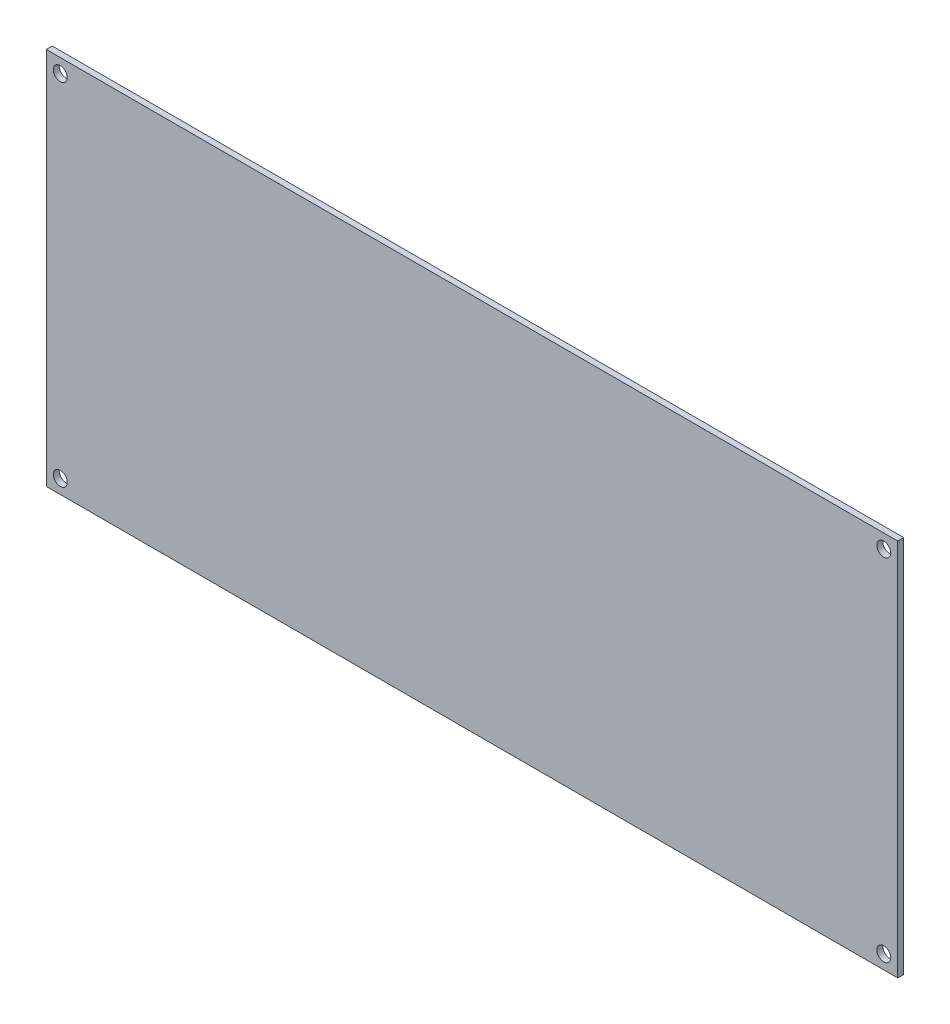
ISO-10303-21;
HEADER;
FILE_DESCRIPTION(('STEP AP214'),'2;1');
FILE_NAME('part.step','',(''),(''),'','','');
FILE_SCHEMA(('AUTOMOTIVE_DESIGN { 1 0 10303 214 1 1 1 1 }'));
ENDSEC;
DATA;
#1=APPLICATION_CONTEXT('core data for automotive mechanical design processes');
#2=APPLICATION_PROTOCOL_DEFINITION('international standard','automotive_design',2000,#1);
#3=PRODUCT_CONTEXT('',#1,'mechanical');
#4=PRODUCT('Part','Part','',(#3));
#5=PRODUCT_RELATED_PRODUCT_CATEGORY('part','',(#4));
#6=PRODUCT_DEFINITION_FORMATION('','',#4);
#7=PRODUCT_DEFINITION_CONTEXT('part definition',#1,'design');
#8=PRODUCT_DEFINITION('design','',#6,#7);
#9=PRODUCT_DEFINITION_SHAPE('','',#8);
#10=(LENGTH_UNIT() NAMED_UNIT(*) SI_UNIT(.MILLI.,.METRE.));
#11=(NAMED_UNIT(*) PLANE_ANGLE_UNIT() SI_UNIT($,.RADIAN.));
#12=(NAMED_UNIT(*) SI_UNIT($,.STERADIAN.) SOLID_ANGLE_UNIT());
#13=UNCERTAINTY_MEASURE_WITH_UNIT(LENGTH_MEASURE(1.E-05),#10,'distance_accuracy_value','');
#14=(GEOMETRIC_REPRESENTATION_CONTEXT(3) GLOBAL_UNCERTAINTY_ASSIGNED_CONTEXT((#13)) GLOBAL_UNIT_ASSIGNED_CONTEXT((#10,
#11,#12)) REPRESENTATION_CONTEXT('',''));
#15=CARTESIAN_POINT('',(0.,0.,0.));
#16=DIRECTION('',(0.,0.,1.));
#17=DIRECTION('',(1.,0.,0.));
#18=AXIS2_PLACEMENT_3D('',#15,#16,#17);
#19=CARTESIAN_POINT('',(0.,0.,1.6));
#20=DIRECTION('',(1.,0.,0.));
#21=DIRECTION('',(0.,0.,-1.));
#22=AXIS2_PLACEMENT_3D('',#19,#20,#21);
#23=PLANE('',#22);
#24=DIRECTION('',(0.,-1.,0.));
#25=VECTOR('',#24,1.);
#26=CARTESIAN_POINT('',(0.,0.,0.));
#27=LINE('',#26,#25);
#28=CARTESIAN_POINT('',(0.,101.6,0.));
#29=VERTEX_POINT('',#28);
#30=CARTESIAN_POINT('',(0.,0.,0.));
#31=VERTEX_POINT('',#30);
#32=EDGE_CURVE('E98',#29,#31,#27,.T.);
#33=ORIENTED_EDGE('',*,*,#32,.T.);
#34=DIRECTION('',(0.,0.,-1.));
#35=VECTOR('',#34,1.);
#36=CARTESIAN_POINT('',(0.,0.,1.6));
#37=LINE('',#36,#35);
#38=CARTESIAN_POINT('',(0.,0.,1.6));
#39=VERTEX_POINT('',#38);
#40=EDGE_CURVE('E11',#39,#31,#37,.T.);
#41=ORIENTED_EDGE('',*,*,#40,.F.);
#42=DIRECTION('',(0.,-1.,0.));
#43=VECTOR('',#42,1.);
#44=CARTESIAN_POINT('',(0.,0.,1.6));
#45=LINE('',#44,#43);
#46=CARTESIAN_POINT('',(0.,101.6,1.6));
#47=VERTEX_POINT('',#46);
#48=EDGE_CURVE('E86',#47,#39,#45,.T.);
#49=ORIENTED_EDGE('',*,*,#48,.F.);
#50=DIRECTION('',(0.,0.,-1.));
#51=VECTOR('',#50,1.);
#52=CARTESIAN_POINT('',(0.,101.6,1.6));
#53=LINE('',#52,#51);
#54=EDGE_CURVE('E94',#47,#29,#53,.T.);
#55=ORIENTED_EDGE('',*,*,#54,.T.);
#56=EDGE_LOOP('',(#33,#41,#49,#55));
#57=FACE_BOUND('',#56,.T.);
#58=ADVANCED_FACE('F35',(#57),#23,.F.);
#59=CARTESIAN_POINT('',(0.,0.,1.6));
#60=DIRECTION('',(0.,1.,0.));
#61=DIRECTION('',(0.,0.,1.));
#62=AXIS2_PLACEMENT_3D('',#59,#60,#61);
#63=PLANE('',#62);
#64=DIRECTION('',(1.,0.,0.));
#65=VECTOR('',#64,1.);
#66=CARTESIAN_POINT('',(0.,0.,0.));
#67=LINE('',#66,#65);
#68=CARTESIAN_POINT('',(228.6,0.,0.));
#69=VERTEX_POINT('',#68);
#70=EDGE_CURVE('E90',#31,#69,#67,.T.);
#71=ORIENTED_EDGE('',*,*,#70,.T.);
#72=DIRECTION('',(0.,0.,-1.));
#73=VECTOR('',#72,1.);
#74=CARTESIAN_POINT('',(228.6,0.,1.6));
#75=LINE('',#74,#73);
#76=CARTESIAN_POINT('',(228.6,0.,1.6));
#77=VERTEX_POINT('',#76);
#78=EDGE_CURVE('E43',#77,#69,#75,.T.);
#79=ORIENTED_EDGE('',*,*,#78,.F.);
#80=DIRECTION('',(1.,0.,0.));
#81=VECTOR('',#80,1.);
#82=CARTESIAN_POINT('',(0.,0.,1.6));
#83=LINE('',#82,#81);
#84=EDGE_CURVE('E81',#39,#77,#83,.T.);
#85=ORIENTED_EDGE('',*,*,#84,.F.);
#86=ORIENTED_EDGE('',*,*,#40,.T.);
#87=EDGE_LOOP('',(#71,#79,#85,#86));
#88=FACE_BOUND('',#87,.T.);
#89=ADVANCED_FACE('F89',(#88),#63,.F.);
#90=CARTESIAN_POINT('',(228.6,0.,1.6));
#91=DIRECTION('',(-1.,0.,0.));
#92=DIRECTION('',(0.,-1.,0.));
#93=AXIS2_PLACEMENT_3D('',#90,#91,#92);
#94=PLANE('',#93);
#95=DIRECTION('',(0.,1.,0.));
#96=VECTOR('',#95,1.);
#97=CARTESIAN_POINT('',(228.6,0.,0.));
#98=LINE('',#97,#96);
#99=CARTESIAN_POINT('',(228.6,101.6,0.));
#100=VERTEX_POINT('',#99);
#101=EDGE_CURVE('E68',#69,#100,#98,.T.);
#102=ORIENTED_EDGE('',*,*,#101,.T.);
#103=DIRECTION('',(0.,0.,-1.));
#104=VECTOR('',#103,1.);
#105=CARTESIAN_POINT('',(228.6,101.6,1.6));
#106=LINE('',#105,#104);
#107=CARTESIAN_POINT('',(228.6,101.6,1.6));
#108=VERTEX_POINT('',#107);
#109=EDGE_CURVE('E91',#108,#100,#106,.T.);
#110=ORIENTED_EDGE('',*,*,#109,.F.);
#111=DIRECTION('',(0.,1.,0.));
#112=VECTOR('',#111,1.);
#113=CARTESIAN_POINT('',(228.6,0.,1.6));
#114=LINE('',#113,#112);
#115=EDGE_CURVE('E84',#77,#108,#114,.T.);
#116=ORIENTED_EDGE('',*,*,#115,.F.);
#117=ORIENTED_EDGE('',*,*,#78,.T.);
#118=EDGE_LOOP('',(#102,#110,#116,#117));
#119=FACE_BOUND('',#118,.T.);
#120=ADVANCED_FACE('F92',(#119),#94,.F.);
#121=CARTESIAN_POINT('',(0.,101.6,1.6));
#122=DIRECTION('',(0.,-1.,0.));
#123=DIRECTION('',(0.,0.,-1.));
#124=AXIS2_PLACEMENT_3D('',#121,#122,#123);
#125=PLANE('',#124);
#126=DIRECTION('',(-1.,0.,0.));
#127=VECTOR('',#126,1.);
#128=CARTESIAN_POINT('',(0.,101.6,0.));
#129=LINE('',#128,#127);
#130=EDGE_CURVE('E74',#100,#29,#129,.T.);
#131=ORIENTED_EDGE('',*,*,#130,.T.);
#132=ORIENTED_EDGE('',*,*,#54,.F.);
#133=DIRECTION('',(-1.,0.,0.));
#134=VECTOR('',#133,1.);
#135=CARTESIAN_POINT('',(0.,101.6,1.6));
#136=LINE('',#135,#134);
#137=EDGE_CURVE('E51',#108,#47,#136,.T.);
#138=ORIENTED_EDGE('',*,*,#137,.F.);
#139=ORIENTED_EDGE('',*,*,#109,.T.);
#140=EDGE_LOOP('',(#131,#132,#138,#139));
#141=FACE_BOUND('',#140,.T.);
#142=ADVANCED_FACE('F106',(#141),#125,.F.);
#143=CARTESIAN_POINT('',(0.,101.6,1.6));
#144=DIRECTION('',(0.,0.,-1.));
#145=DIRECTION('',(-1.,0.,0.));
#146=AXIS2_PLACEMENT_3D('',#143,#144,#145);
#147=PLANE('',#146);
#148=CARTESIAN_POINT('',(3.75,3.75,1.6));
#149=DIRECTION('',(0.,0.,1.));
#150=DIRECTION('',(1.,0.,0.));
#151=AXIS2_PLACEMENT_3D('',#148,#149,#150);
#152=CIRCLE('',#151,1.875);
#153=CARTESIAN_POINT('',(5.62500000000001,3.75,1.6));
#154=VERTEX_POINT('',#153);
#155=EDGE_CURVE('E130',#154,#154,#152,.T.);
#156=ORIENTED_EDGE('',*,*,#155,.F.);
#157=EDGE_LOOP('',(#156));
#158=FACE_BOUND('',#157,.T.);
#159=CARTESIAN_POINT('',(224.85,3.75,1.6));
#160=DIRECTION('',(0.,0.,1.));
#161=DIRECTION('',(1.,0.,0.));
#162=AXIS2_PLACEMENT_3D('',#159,#160,#161);
#163=CIRCLE('',#162,1.87499999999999);
#164=CARTESIAN_POINT('',(226.725,3.75,1.6));
#165=VERTEX_POINT('',#164);
#166=EDGE_CURVE('E124',#165,#165,#163,.T.);
#167=ORIENTED_EDGE('',*,*,#166,.F.);
#168=EDGE_LOOP('',(#167));
#169=FACE_BOUND('',#168,.T.);
#170=CARTESIAN_POINT('',(224.85,97.85,1.6));
#171=DIRECTION('',(0.,0.,1.));
#172=DIRECTION('',(1.,0.,0.));
#173=AXIS2_PLACEMENT_3D('',#170,#171,#172);
#174=CIRCLE('',#173,1.87499999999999);
#175=CARTESIAN_POINT('',(226.725,97.85,1.6));
#176=VERTEX_POINT('',#175);
#177=EDGE_CURVE('E118',#176,#176,#174,.T.);
#178=ORIENTED_EDGE('',*,*,#177,.F.);
#179=EDGE_LOOP('',(#178));
#180=FACE_BOUND('',#179,.T.);
#181=CARTESIAN_POINT('',(3.75,97.85,1.6));
#182=DIRECTION('',(0.,0.,1.));
#183=DIRECTION('',(1.,0.,0.));
#184=AXIS2_PLACEMENT_3D('',#181,#182,#183);
#185=CIRCLE('',#184,1.875);
#186=CARTESIAN_POINT('',(5.62500000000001,97.85,1.6));
#187=VERTEX_POINT('',#186);
#188=EDGE_CURVE('E112',#187,#187,#185,.T.);
#189=ORIENTED_EDGE('',*,*,#188,.F.);
#190=EDGE_LOOP('',(#189));
#191=FACE_BOUND('',#190,.T.);
#192=ORIENTED_EDGE('',*,*,#48,.T.);
#193=ORIENTED_EDGE('',*,*,#84,.T.);
#194=ORIENTED_EDGE('',*,*,#115,.T.);
#195=ORIENTED_EDGE('',*,*,#137,.T.);
#196=EDGE_LOOP('',(#192,#193,#194,#195));
#197=FACE_BOUND('',#196,.T.);
#198=ADVANCED_FACE('F82',(#158,#169,#180,#191,#197),#147,.F.);
#199=CARTESIAN_POINT('',(0.,101.6,0.));
#200=DIRECTION('',(0.,0.,-1.));
#201=DIRECTION('',(-1.,0.,0.));
#202=AXIS2_PLACEMENT_3D('',#199,#200,#201);
#203=PLANE('',#202);
#204=CARTESIAN_POINT('',(3.75,3.75,0.));
#205=DIRECTION('',(0.,0.,1.));
#206=DIRECTION('',(1.,0.,0.));
#207=AXIS2_PLACEMENT_3D('',#204,#205,#206);
#208=CIRCLE('',#207,1.875);
#209=CARTESIAN_POINT('',(5.62500000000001,3.75,0.));
#210=VERTEX_POINT('',#209);
#211=EDGE_CURVE('E127',#210,#210,#208,.T.);
#212=ORIENTED_EDGE('',*,*,#211,.T.);
#213=EDGE_LOOP('',(#212));
#214=FACE_BOUND('',#213,.T.);
#215=CARTESIAN_POINT('',(224.85,3.75,0.));
#216=DIRECTION('',(0.,0.,1.));
#217=DIRECTION('',(1.,0.,0.));
#218=AXIS2_PLACEMENT_3D('',#215,#216,#217);
#219=CIRCLE('',#218,1.87499999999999);
#220=CARTESIAN_POINT('',(226.725,3.75,0.));
#221=VERTEX_POINT('',#220);
#222=EDGE_CURVE('E121',#221,#221,#219,.T.);
#223=ORIENTED_EDGE('',*,*,#222,.T.);
#224=EDGE_LOOP('',(#223));
#225=FACE_BOUND('',#224,.T.);
#226=CARTESIAN_POINT('',(224.85,97.85,0.));
#227=DIRECTION('',(0.,0.,1.));
#228=DIRECTION('',(1.,0.,0.));
#229=AXIS2_PLACEMENT_3D('',#226,#227,#228);
#230=CIRCLE('',#229,1.87499999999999);
#231=CARTESIAN_POINT('',(226.725,97.85,0.));
#232=VERTEX_POINT('',#231);
#233=EDGE_CURVE('E115',#232,#232,#230,.T.);
#234=ORIENTED_EDGE('',*,*,#233,.T.);
#235=EDGE_LOOP('',(#234));
#236=FACE_BOUND('',#235,.T.);
#237=CARTESIAN_POINT('',(3.75,97.85,0.));
#238=DIRECTION('',(0.,0.,1.));
#239=DIRECTION('',(1.,0.,0.));
#240=AXIS2_PLACEMENT_3D('',#237,#238,#239);
#241=CIRCLE('',#240,1.875);
#242=CARTESIAN_POINT('',(5.62500000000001,97.85,0.));
#243=VERTEX_POINT('',#242);
#244=EDGE_CURVE('E101',#243,#243,#241,.T.);
#245=ORIENTED_EDGE('',*,*,#244,.T.);
#246=EDGE_LOOP('',(#245));
#247=FACE_BOUND('',#246,.T.);
#248=ORIENTED_EDGE('',*,*,#32,.F.);
#249=ORIENTED_EDGE('',*,*,#130,.F.);
#250=ORIENTED_EDGE('',*,*,#101,.F.);
#251=ORIENTED_EDGE('',*,*,#70,.F.);
#252=EDGE_LOOP('',(#248,#249,#250,#251));
#253=FACE_BOUND('',#252,.T.);
#254=ADVANCED_FACE('F109',(#214,#225,#236,#247,#253),#203,.T.);
#255=CARTESIAN_POINT('',(3.75,97.85,0.));
#256=DIRECTION('',(0.,0.,1.));
#257=DIRECTION('',(1.,0.,0.));
#258=AXIS2_PLACEMENT_3D('',#255,#256,#257);
#259=CYLINDRICAL_SURFACE('',#258,1.875);
#260=ORIENTED_EDGE('',*,*,#244,.F.);
#261=EDGE_LOOP('',(#260));
#262=FACE_BOUND('',#261,.T.);
#263=ORIENTED_EDGE('',*,*,#188,.T.);
#264=EDGE_LOOP('',(#263));
#265=FACE_BOUND('',#264,.T.);
#266=ADVANCED_FACE('F154',(#262,#265),#259,.F.);
#267=CARTESIAN_POINT('',(224.85,97.85,0.));
#268=DIRECTION('',(0.,0.,1.));
#269=DIRECTION('',(1.,0.,0.));
#270=AXIS2_PLACEMENT_3D('',#267,#268,#269);
#271=CYLINDRICAL_SURFACE('',#270,1.87499999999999);
#272=ORIENTED_EDGE('',*,*,#233,.F.);
#273=EDGE_LOOP('',(#272));
#274=FACE_BOUND('',#273,.T.);
#275=ORIENTED_EDGE('',*,*,#177,.T.);
#276=EDGE_LOOP('',(#275));
#277=FACE_BOUND('',#276,.T.);
#278=ADVANCED_FACE('F156',(#274,#277),#271,.F.);
#279=CARTESIAN_POINT('',(224.85,3.75,0.));
#280=DIRECTION('',(0.,0.,1.));
#281=DIRECTION('',(1.,0.,0.));
#282=AXIS2_PLACEMENT_3D('',#279,#280,#281);
#283=CYLINDRICAL_SURFACE('',#282,1.87499999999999);
#284=ORIENTED_EDGE('',*,*,#222,.F.);
#285=EDGE_LOOP('',(#284));
#286=FACE_BOUND('',#285,.T.);
#287=ORIENTED_EDGE('',*,*,#166,.T.);
#288=EDGE_LOOP('',(#287));
#289=FACE_BOUND('',#288,.T.);
#290=ADVANCED_FACE('F141',(#286,#289),#283,.F.);
#291=CARTESIAN_POINT('',(3.75,3.75,0.));
#292=DIRECTION('',(0.,0.,1.));
#293=DIRECTION('',(1.,0.,0.));
#294=AXIS2_PLACEMENT_3D('',#291,#292,#293);
#295=CYLINDRICAL_SURFACE('',#294,1.875);
#296=ORIENTED_EDGE('',*,*,#211,.F.);
#297=EDGE_LOOP('',(#296));
#298=FACE_BOUND('',#297,.T.);
#299=ORIENTED_EDGE('',*,*,#155,.T.);
#300=EDGE_LOOP('',(#299));
#301=FACE_BOUND('',#300,.T.);
#302=ADVANCED_FACE('F138',(#298,#301),#295,.F.);
#303=CLOSED_SHELL('',(#58,#89,#120,#142,#198,#254,#266,#278,#290,#302));
#304=MANIFOLD_SOLID_BREP('B2',#303);
#305=ADVANCED_BREP_SHAPE_REPRESENTATION('',(#18,#304),#14);
#306=SHAPE_DEFINITION_REPRESENTATION(#9,#305);
ENDSEC;
END-ISO-10303-21;
